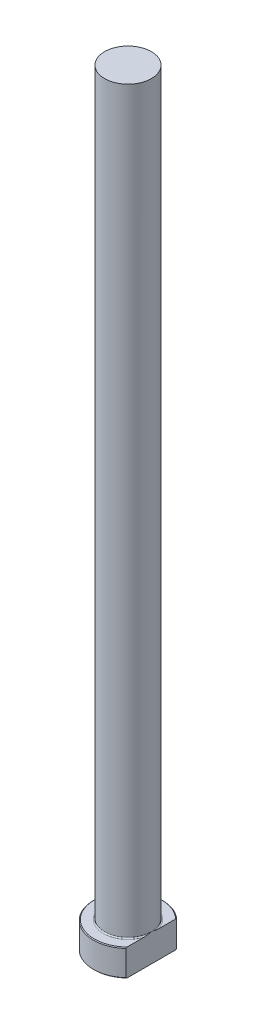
from build123d import *
from build123d.topology import SkipClean

# Parameters (mm, degrees)
CHAMFER1_SIZE = 0.2
FILLET1_R     = 0.3
KEY_DEPTH     = 201.404590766


with BuildPart() as part:
    # Sketch1 → Revolve1 (revolve)
    with BuildSketch(Plane.XY, mode=Mode.PRIVATE) as revolve1_sk:
        Polygon((0, 0), (-9, 0), (-9, 7), (-6.1, 7), (-6.1, 200), (0, 200), align=None)
    revolve(revolve1_sk.sketch.rotate(Axis((0, 259.958771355, 0), (0, -1, 0)), 270), axis=Axis((0, 259.958771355, 0), (0, -1, 0)))

    # Chamfer1
    chamfer1_edges = [part.edges().sort_by_distance(p)[0] for p in [
        (0, 7, -9),
        (0, 0, -9),
    ]]
    chamfer(chamfer1_edges, length=CHAMFER1_SIZE)

    # Fillet1
    fillet1_edges = [part.edges().sort_by_distance(p)[0] for p in [
        (0, 7, -6.1),
    ]]
    fillet(fillet1_edges, radius=FILLET1_R)

    # Sketch2 → KEY (cut, through all)
    with SkipClean():  # the faces are left unmerged after this step: merging them gives an invalid solid
        with BuildSketch(Plane(origin=(0, 0, 0), x_dir=(1, 0, 0), z_dir=(0, 1, 0))):
            with BuildLine():
                Line((6.1, 6.617401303), (6.1, -6.617401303))
                ThreePointArc((6.1, -6.617401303), (9, 0), (6.1, 6.617401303))
            make_face()
        extrude(amount=KEY_DEPTH, mode=Mode.SUBTRACT)


solid = part.part
